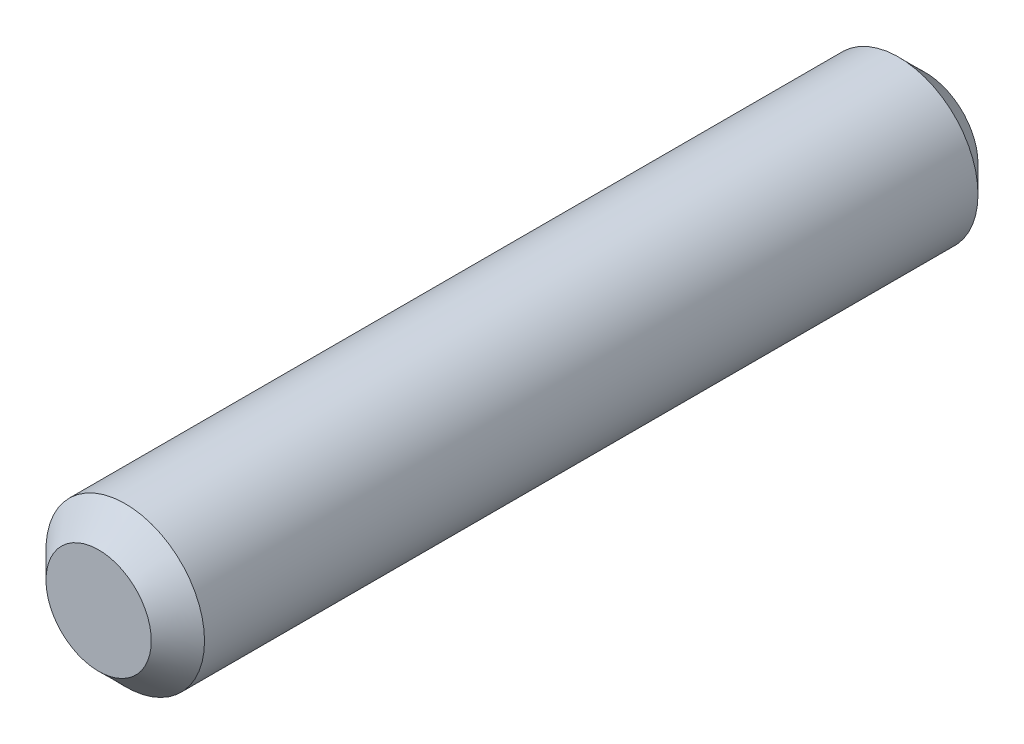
from build123d import *


with BuildPart() as part:
    # Sketch 1 → Revolve 1 (revolve)
    with BuildSketch(Plane(origin=(0, 0, 0), x_dir=(0, 0, -1), z_dir=(1, 0, 0)), mode=Mode.PRIVATE) as revolve_1_sk:
        Polygon((-6.1595, 0.784225), (-5.762625, 1.1811), (5.762625, 1.1811), (6.1595, 0.784225), (6.1595, 0), (-6.1595, 0), align=None)
    revolve(revolve_1_sk.sketch.rotate(Axis((0, 0, 51.788969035), (0, 0, -1)), 90), axis=Axis((0, 0, 51.788969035), (0, 0, -1)))


solid = part.part
